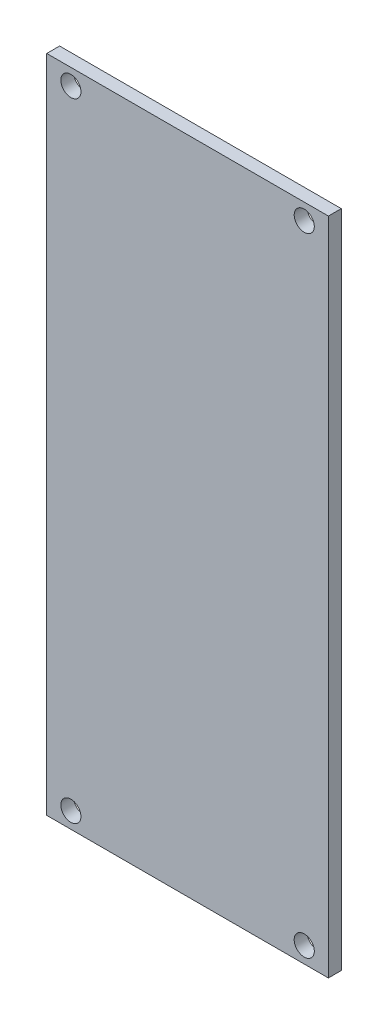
from build123d import *

# Parameters (mm, degrees)
SKETCH1_W            = 44.45
SKETCH1_H            = 104.14
BASE_EXTRUDE_DEPTH   = 2.032
SKETCH2_R            = 1.5875
MOUNTING_HOLES_DEPTH = 114.247830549


with BuildPart() as part:
    # Sketch1 → Base-Extrude (new body)
    with BuildSketch(Plane.XY):
        with Locations((22.225, 52.07)):
            Rectangle(SKETCH1_W, SKETCH1_H)
    extrude(amount=-BASE_EXTRUDE_DEPTH)

    # Sketch2 → MOUNTING HOLES (cut, through all)
    with BuildSketch(Plane.XY):
        with Locations((3.81, 101.6)):
            Circle(SKETCH2_R)
        with Locations((40.64, 101.6)):
            Circle(SKETCH2_R)
        with Locations((3.81, 2.54)):
            Circle(SKETCH2_R)
        with Locations((40.64, 2.54)):
            Circle(SKETCH2_R)
    extrude(amount=-MOUNTING_HOLES_DEPTH, mode=Mode.SUBTRACT)


solid = part.part
